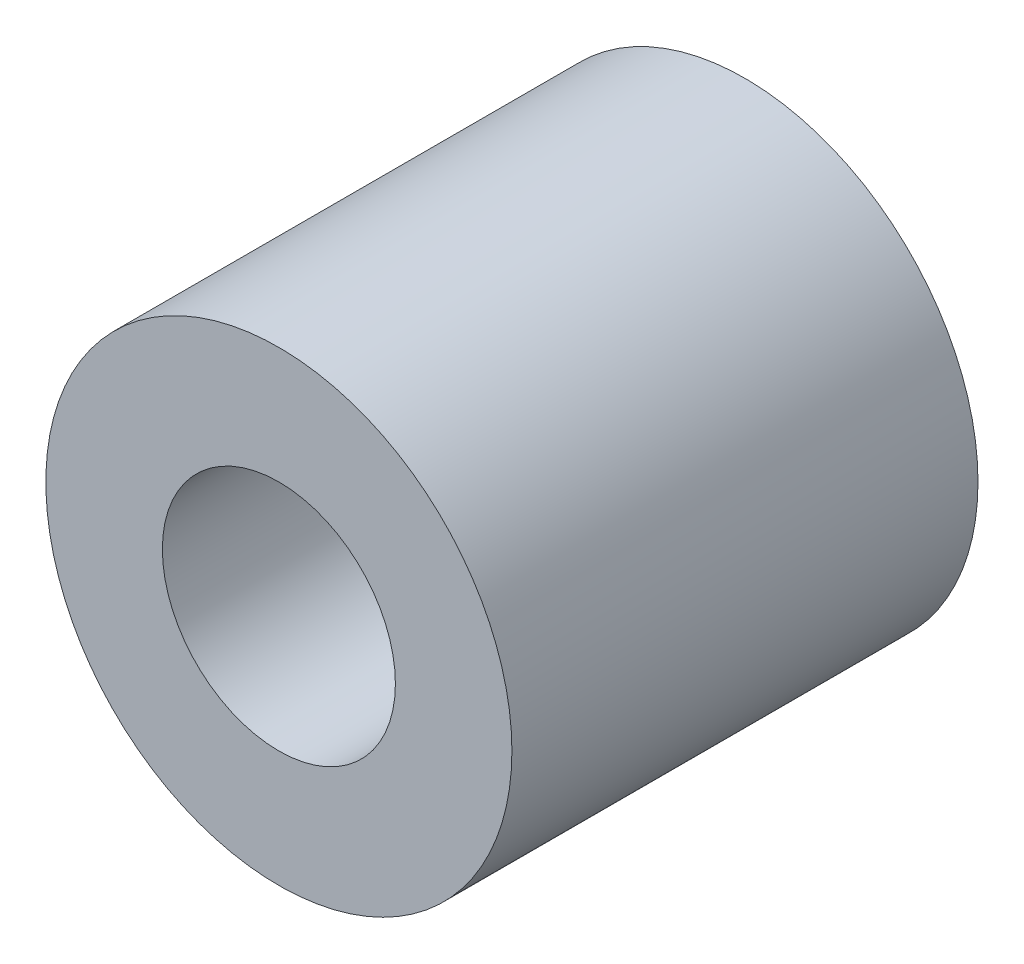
ISO-10303-21;
HEADER;
FILE_DESCRIPTION(('STEP AP214'),'2;1');
FILE_NAME('part.step','',(''),(''),'','','');
FILE_SCHEMA(('AUTOMOTIVE_DESIGN { 1 0 10303 214 1 1 1 1 }'));
ENDSEC;
DATA;
#1=APPLICATION_CONTEXT('core data for automotive mechanical design processes');
#2=APPLICATION_PROTOCOL_DEFINITION('international standard','automotive_design',2000,#1);
#3=PRODUCT_CONTEXT('',#1,'mechanical');
#4=PRODUCT('Part','Part','',(#3));
#5=PRODUCT_RELATED_PRODUCT_CATEGORY('part','',(#4));
#6=PRODUCT_DEFINITION_FORMATION('','',#4);
#7=PRODUCT_DEFINITION_CONTEXT('part definition',#1,'design');
#8=PRODUCT_DEFINITION('design','',#6,#7);
#9=PRODUCT_DEFINITION_SHAPE('','',#8);
#10=(LENGTH_UNIT() NAMED_UNIT(*) SI_UNIT(.MILLI.,.METRE.));
#11=(NAMED_UNIT(*) PLANE_ANGLE_UNIT() SI_UNIT($,.RADIAN.));
#12=(NAMED_UNIT(*) SI_UNIT($,.STERADIAN.) SOLID_ANGLE_UNIT());
#13=UNCERTAINTY_MEASURE_WITH_UNIT(LENGTH_MEASURE(1.E-05),#10,'distance_accuracy_value','');
#14=(GEOMETRIC_REPRESENTATION_CONTEXT(3) GLOBAL_UNCERTAINTY_ASSIGNED_CONTEXT((#13)) GLOBAL_UNIT_ASSIGNED_CONTEXT((#10,
#11,#12)) REPRESENTATION_CONTEXT('',''));
#15=CARTESIAN_POINT('',(0.,0.,0.));
#16=DIRECTION('',(0.,0.,1.));
#17=DIRECTION('',(1.,0.,0.));
#18=AXIS2_PLACEMENT_3D('',#15,#16,#17);
#19=CARTESIAN_POINT('',(0.,-1.66533453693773E-13,-20.0000000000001));
#20=DIRECTION('',(0.,0.,1.));
#21=DIRECTION('',(1.,0.,0.));
#22=AXIS2_PLACEMENT_3D('',#19,#20,#21);
#23=CYLINDRICAL_SURFACE('',#22,5.);
#24=CARTESIAN_POINT('',(0.,0.,0.));
#25=DIRECTION('',(0.,0.,1.));
#26=DIRECTION('',(1.,0.,0.));
#27=AXIS2_PLACEMENT_3D('',#24,#25,#26);
#28=CIRCLE('',#27,5.);
#29=CARTESIAN_POINT('',(5.00000000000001,0.,0.));
#30=VERTEX_POINT('',#29);
#31=EDGE_CURVE('E146',#30,#30,#28,.T.);
#32=ORIENTED_EDGE('',*,*,#31,.T.);
#33=EDGE_LOOP('',(#32));
#34=FACE_BOUND('',#33,.T.);
#35=CARTESIAN_POINT('',(0.,0.,-11.));
#36=DIRECTION('',(0.,0.,-1.));
#37=DIRECTION('',(-1.,0.,0.));
#38=AXIS2_PLACEMENT_3D('',#35,#36,#37);
#39=CIRCLE('',#38,5.);
#40=CARTESIAN_POINT('',(-5.00000000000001,0.,-11.));
#41=VERTEX_POINT('',#40);
#42=EDGE_CURVE('E40',#41,#41,#39,.F.);
#43=ORIENTED_EDGE('',*,*,#42,.F.);
#44=EDGE_LOOP('',(#43));
#45=FACE_BOUND('',#44,.T.);
#46=ADVANCED_FACE('F36',(#34,#45),#23,.F.);
#47=CARTESIAN_POINT('',(0.,-1.66533453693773E-13,-20.0000000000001));
#48=DIRECTION('',(0.,0.,1.));
#49=DIRECTION('',(1.,0.,0.));
#50=AXIS2_PLACEMENT_3D('',#47,#48,#49);
#51=CYLINDRICAL_SURFACE('',#50,10.);
#52=CARTESIAN_POINT('',(0.,-1.66533453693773E-13,-20.0000000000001));
#53=DIRECTION('',(0.,0.,1.));
#54=DIRECTION('',(1.,0.,0.));
#55=AXIS2_PLACEMENT_3D('',#52,#53,#54);
#56=CIRCLE('',#55,10.);
#57=CARTESIAN_POINT('',(9.99999999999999,-1.66303264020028E-13,-20.0000000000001));
#58=VERTEX_POINT('',#57);
#59=EDGE_CURVE('E13',#58,#58,#56,.T.);
#60=ORIENTED_EDGE('',*,*,#59,.T.);
#61=EDGE_LOOP('',(#60));
#62=FACE_BOUND('',#61,.T.);
#63=CARTESIAN_POINT('',(0.,0.,0.));
#64=DIRECTION('',(0.,0.,1.));
#65=DIRECTION('',(1.,0.,0.));
#66=AXIS2_PLACEMENT_3D('',#63,#64,#65);
#67=CIRCLE('',#66,10.);
#68=CARTESIAN_POINT('',(10.,0.,0.));
#69=VERTEX_POINT('',#68);
#70=EDGE_CURVE('E45',#69,#69,#67,.T.);
#71=ORIENTED_EDGE('',*,*,#70,.F.);
#72=EDGE_LOOP('',(#71));
#73=FACE_BOUND('',#72,.T.);
#74=ADVANCED_FACE('F38',(#62,#73),#51,.T.);
#75=CARTESIAN_POINT('',(0.,-1.66533453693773E-13,-20.0000000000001));
#76=DIRECTION('',(0.,0.,1.));
#77=DIRECTION('',(1.,0.,0.));
#78=AXIS2_PLACEMENT_3D('',#75,#76,#77);
#79=PLANE('',#78);
#80=DIRECTION('',(-0.500000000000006,-0.866025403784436,0.));
#81=VECTOR('',#80,1.);
#82=CARTESIAN_POINT('',(6.92820323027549,0.,-20.0000000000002));
#83=LINE('',#82,#81);
#84=CARTESIAN_POINT('',(6.92820323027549,0.,-20.0000000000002));
#85=VERTEX_POINT('',#84);
#86=CARTESIAN_POINT('',(3.46410161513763,-6.00000000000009,-20.0000000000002));
#87=VERTEX_POINT('',#86);
#88=EDGE_CURVE('E106',#85,#87,#83,.T.);
#89=ORIENTED_EDGE('',*,*,#88,.F.);
#90=DIRECTION('',(0.499999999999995,-0.866025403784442,0.));
#91=VECTOR('',#90,1.);
#92=CARTESIAN_POINT('',(3.46410161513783,6.00000000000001,-20.0000000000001));
#93=LINE('',#92,#91);
#94=CARTESIAN_POINT('',(3.46410161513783,6.00000000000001,-20.0000000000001));
#95=VERTEX_POINT('',#94);
#96=EDGE_CURVE('E52',#95,#85,#93,.T.);
#97=ORIENTED_EDGE('',*,*,#96,.F.);
#98=DIRECTION('',(1.,0.,0.));
#99=VECTOR('',#98,1.);
#100=CARTESIAN_POINT('',(-3.46410161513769,5.99999999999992,-20.0000000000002));
#101=LINE('',#100,#99);
#102=CARTESIAN_POINT('',(-3.46410161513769,5.99999999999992,-20.0000000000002));
#103=VERTEX_POINT('',#102);
#104=EDGE_CURVE('E122',#103,#95,#101,.T.);
#105=ORIENTED_EDGE('',*,*,#104,.F.);
#106=DIRECTION('',(0.500000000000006,0.866025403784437,0.));
#107=VECTOR('',#106,1.);
#108=CARTESIAN_POINT('',(-6.92820323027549,-1.38777878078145E-13,-20.0000000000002));
#109=LINE('',#108,#107);
#110=CARTESIAN_POINT('',(-6.92820323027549,-1.38777878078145E-13,-20.0000000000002));
#111=VERTEX_POINT('',#110);
#112=EDGE_CURVE('E116',#111,#103,#109,.T.);
#113=ORIENTED_EDGE('',*,*,#112,.F.);
#114=DIRECTION('',(-0.499999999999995,0.866025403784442,0.));
#115=VECTOR('',#114,1.);
#116=CARTESIAN_POINT('',(-3.4641016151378,-5.99999999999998,-20.0000000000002));
#117=LINE('',#116,#115);
#118=CARTESIAN_POINT('',(-3.4641016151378,-5.99999999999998,-20.0000000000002));
#119=VERTEX_POINT('',#118);
#120=EDGE_CURVE('E114',#119,#111,#117,.T.);
#121=ORIENTED_EDGE('',*,*,#120,.F.);
#122=DIRECTION('',(-1.,0.,0.));
#123=VECTOR('',#122,1.);
#124=CARTESIAN_POINT('',(3.46410161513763,-6.00000000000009,-20.0000000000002));
#125=LINE('',#124,#123);
#126=EDGE_CURVE('E95',#87,#119,#125,.T.);
#127=ORIENTED_EDGE('',*,*,#126,.F.);
#128=EDGE_LOOP('',(#89,#97,#105,#113,#121,#127));
#129=FACE_BOUND('',#128,.T.);
#130=ORIENTED_EDGE('',*,*,#59,.F.);
#131=EDGE_LOOP('',(#130));
#132=FACE_BOUND('',#131,.T.);
#133=ADVANCED_FACE('F110',(#129,#132),#79,.F.);
#134=CARTESIAN_POINT('',(0.,0.,0.));
#135=DIRECTION('',(0.,0.,1.));
#136=DIRECTION('',(1.,0.,0.));
#137=AXIS2_PLACEMENT_3D('',#134,#135,#136);
#138=PLANE('',#137);
#139=ORIENTED_EDGE('',*,*,#31,.F.);
#140=EDGE_LOOP('',(#139));
#141=FACE_BOUND('',#140,.T.);
#142=ORIENTED_EDGE('',*,*,#70,.T.);
#143=EDGE_LOOP('',(#142));
#144=FACE_BOUND('',#143,.T.);
#145=ADVANCED_FACE('F152',(#141,#144),#138,.T.);
#146=CARTESIAN_POINT('',(6.92820323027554,0.,-11.));
#147=DIRECTION('',(0.,0.,-1.));
#148=DIRECTION('',(-1.,0.,0.));
#149=AXIS2_PLACEMENT_3D('',#146,#147,#148);
#150=PLANE('',#149);
#151=DIRECTION('',(0.499999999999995,-0.866025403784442,0.));
#152=VECTOR('',#151,1.);
#153=CARTESIAN_POINT('',(3.46410161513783,6.00000000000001,-11.));
#154=LINE('',#153,#152);
#155=CARTESIAN_POINT('',(3.46410161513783,6.00000000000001,-11.));
#156=VERTEX_POINT('',#155);
#157=CARTESIAN_POINT('',(6.92820323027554,0.,-11.));
#158=VERTEX_POINT('',#157);
#159=EDGE_CURVE('E124',#156,#158,#154,.T.);
#160=ORIENTED_EDGE('',*,*,#159,.T.);
#161=DIRECTION('',(-0.500000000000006,-0.866025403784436,0.));
#162=VECTOR('',#161,1.);
#163=CARTESIAN_POINT('',(6.92820323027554,0.,-11.));
#164=LINE('',#163,#162);
#165=CARTESIAN_POINT('',(3.46410161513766,-6.0000000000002,-11.0000000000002));
#166=VERTEX_POINT('',#165);
#167=EDGE_CURVE('E127',#158,#166,#164,.T.);
#168=ORIENTED_EDGE('',*,*,#167,.T.);
#169=DIRECTION('',(-1.,0.,0.));
#170=VECTOR('',#169,1.);
#171=CARTESIAN_POINT('',(3.46410161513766,-6.0000000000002,-11.0000000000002));
#172=LINE('',#171,#170);
#173=CARTESIAN_POINT('',(-3.46410161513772,-5.99999999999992,-10.9999999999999));
#174=VERTEX_POINT('',#173);
#175=EDGE_CURVE('E98',#166,#174,#172,.T.);
#176=ORIENTED_EDGE('',*,*,#175,.T.);
#177=DIRECTION('',(-0.499999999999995,0.866025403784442,0.));
#178=VECTOR('',#177,1.);
#179=CARTESIAN_POINT('',(-3.46410161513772,-5.99999999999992,-10.9999999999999));
#180=LINE('',#179,#178);
#181=CARTESIAN_POINT('',(-6.92820323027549,0.,-11.0000000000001));
#182=VERTEX_POINT('',#181);
#183=EDGE_CURVE('E130',#174,#182,#180,.T.);
#184=ORIENTED_EDGE('',*,*,#183,.T.);
#185=DIRECTION('',(0.500000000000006,0.866025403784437,0.));
#186=VECTOR('',#185,1.);
#187=CARTESIAN_POINT('',(-6.92820323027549,0.,-11.0000000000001));
#188=LINE('',#187,#186);
#189=CARTESIAN_POINT('',(-3.46410161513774,5.99999999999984,-10.9999999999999));
#190=VERTEX_POINT('',#189);
#191=EDGE_CURVE('E133',#182,#190,#188,.T.);
#192=ORIENTED_EDGE('',*,*,#191,.T.);
#193=DIRECTION('',(1.,0.,0.));
#194=VECTOR('',#193,1.);
#195=CARTESIAN_POINT('',(-3.46410161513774,5.99999999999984,-10.9999999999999));
#196=LINE('',#195,#194);
#197=EDGE_CURVE('E136',#190,#156,#196,.T.);
#198=ORIENTED_EDGE('',*,*,#197,.T.);
#199=EDGE_LOOP('',(#160,#168,#176,#184,#192,#198));
#200=FACE_BOUND('',#199,.T.);
#201=ORIENTED_EDGE('',*,*,#42,.T.);
#202=EDGE_LOOP('',(#201));
#203=FACE_BOUND('',#202,.T.);
#204=ADVANCED_FACE('F172',(#200,#203),#150,.T.);
#205=CARTESIAN_POINT('',(3.46410161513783,6.00000000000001,-11.));
#206=DIRECTION('',(0.866025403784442,0.499999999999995,0.));
#207=DIRECTION('',(-0.499999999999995,0.866025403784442,0.));
#208=AXIS2_PLACEMENT_3D('',#205,#206,#207);
#209=PLANE('',#208);
#210=ORIENTED_EDGE('',*,*,#96,.T.);
#211=DIRECTION('',(0.,0.,-1.));
#212=VECTOR('',#211,1.);
#213=CARTESIAN_POINT('',(6.92820323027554,0.,-11.));
#214=LINE('',#213,#212);
#215=EDGE_CURVE('E103',#158,#85,#214,.T.);
#216=ORIENTED_EDGE('',*,*,#215,.F.);
#217=ORIENTED_EDGE('',*,*,#159,.F.);
#218=DIRECTION('',(0.,0.,-1.));
#219=VECTOR('',#218,1.);
#220=CARTESIAN_POINT('',(3.46410161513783,6.00000000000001,-11.));
#221=LINE('',#220,#219);
#222=EDGE_CURVE('E59',#156,#95,#221,.T.);
#223=ORIENTED_EDGE('',*,*,#222,.T.);
#224=EDGE_LOOP('',(#210,#216,#217,#223));
#225=FACE_BOUND('',#224,.T.);
#226=ADVANCED_FACE('F169',(#225),#209,.F.);
#227=CARTESIAN_POINT('',(-3.46410161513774,5.99999999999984,-10.9999999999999));
#228=DIRECTION('',(0.,1.,0.));
#229=DIRECTION('',(-1.,0.,0.));
#230=AXIS2_PLACEMENT_3D('',#227,#228,#229);
#231=PLANE('',#230);
#232=ORIENTED_EDGE('',*,*,#104,.T.);
#233=ORIENTED_EDGE('',*,*,#222,.F.);
#234=ORIENTED_EDGE('',*,*,#197,.F.);
#235=DIRECTION('',(0.,0.,-1.));
#236=VECTOR('',#235,1.);
#237=CARTESIAN_POINT('',(-3.46410161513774,5.99999999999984,-10.9999999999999));
#238=LINE('',#237,#236);
#239=EDGE_CURVE('E140',#190,#103,#238,.T.);
#240=ORIENTED_EDGE('',*,*,#239,.T.);
#241=EDGE_LOOP('',(#232,#233,#234,#240));
#242=FACE_BOUND('',#241,.T.);
#243=ADVANCED_FACE('F182',(#242),#231,.F.);
#244=CARTESIAN_POINT('',(-6.92820323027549,0.,-11.0000000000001));
#245=DIRECTION('',(-0.866025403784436,0.500000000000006,0.));
#246=DIRECTION('',(-0.500000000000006,-0.866025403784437,0.));
#247=AXIS2_PLACEMENT_3D('',#244,#245,#246);
#248=PLANE('',#247);
#249=ORIENTED_EDGE('',*,*,#112,.T.);
#250=ORIENTED_EDGE('',*,*,#239,.F.);
#251=ORIENTED_EDGE('',*,*,#191,.F.);
#252=DIRECTION('',(0.,0.,-1.));
#253=VECTOR('',#252,1.);
#254=CARTESIAN_POINT('',(-6.92820323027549,0.,-11.0000000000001));
#255=LINE('',#254,#253);
#256=EDGE_CURVE('E142',#182,#111,#255,.T.);
#257=ORIENTED_EDGE('',*,*,#256,.T.);
#258=EDGE_LOOP('',(#249,#250,#251,#257));
#259=FACE_BOUND('',#258,.T.);
#260=ADVANCED_FACE('F187',(#259),#248,.F.);
#261=CARTESIAN_POINT('',(-3.46410161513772,-5.99999999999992,-10.9999999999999));
#262=DIRECTION('',(-0.866025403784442,-0.499999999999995,0.));
#263=DIRECTION('',(0.499999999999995,-0.866025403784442,0.));
#264=AXIS2_PLACEMENT_3D('',#261,#262,#263);
#265=PLANE('',#264);
#266=ORIENTED_EDGE('',*,*,#120,.T.);
#267=ORIENTED_EDGE('',*,*,#256,.F.);
#268=ORIENTED_EDGE('',*,*,#183,.F.);
#269=DIRECTION('',(0.,0.,-1.));
#270=VECTOR('',#269,1.);
#271=CARTESIAN_POINT('',(-3.46410161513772,-5.99999999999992,-10.9999999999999));
#272=LINE('',#271,#270);
#273=EDGE_CURVE('E102',#174,#119,#272,.T.);
#274=ORIENTED_EDGE('',*,*,#273,.T.);
#275=EDGE_LOOP('',(#266,#267,#268,#274));
#276=FACE_BOUND('',#275,.T.);
#277=ADVANCED_FACE('F190',(#276),#265,.F.);
#278=CARTESIAN_POINT('',(3.46410161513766,-6.0000000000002,-11.0000000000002));
#279=DIRECTION('',(0.,-1.,0.));
#280=DIRECTION('',(1.,0.,0.));
#281=AXIS2_PLACEMENT_3D('',#278,#279,#280);
#282=PLANE('',#281);
#283=ORIENTED_EDGE('',*,*,#126,.T.);
#284=ORIENTED_EDGE('',*,*,#273,.F.);
#285=ORIENTED_EDGE('',*,*,#175,.F.);
#286=DIRECTION('',(0.,0.,-1.));
#287=VECTOR('',#286,1.);
#288=CARTESIAN_POINT('',(3.46410161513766,-6.0000000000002,-11.0000000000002));
#289=LINE('',#288,#287);
#290=EDGE_CURVE('E91',#166,#87,#289,.T.);
#291=ORIENTED_EDGE('',*,*,#290,.T.);
#292=EDGE_LOOP('',(#283,#284,#285,#291));
#293=FACE_BOUND('',#292,.T.);
#294=ADVANCED_FACE('F93',(#293),#282,.F.);
#295=CARTESIAN_POINT('',(6.92820323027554,0.,-11.));
#296=DIRECTION('',(0.866025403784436,-0.500000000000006,0.));
#297=DIRECTION('',(0.500000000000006,0.866025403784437,0.));
#298=AXIS2_PLACEMENT_3D('',#295,#296,#297);
#299=PLANE('',#298);
#300=ORIENTED_EDGE('',*,*,#88,.T.);
#301=ORIENTED_EDGE('',*,*,#290,.F.);
#302=ORIENTED_EDGE('',*,*,#167,.F.);
#303=ORIENTED_EDGE('',*,*,#215,.T.);
#304=EDGE_LOOP('',(#300,#301,#302,#303));
#305=FACE_BOUND('',#304,.T.);
#306=ADVANCED_FACE('F107',(#305),#299,.F.);
#307=CLOSED_SHELL('',(#46,#74,#133,#145,#204,#226,#243,#260,#277,#294,#306));
#308=MANIFOLD_SOLID_BREP('B2',#307);
#309=ADVANCED_BREP_SHAPE_REPRESENTATION('',(#18,#308),#14);
#310=SHAPE_DEFINITION_REPRESENTATION(#9,#309);
ENDSEC;
END-ISO-10303-21;
